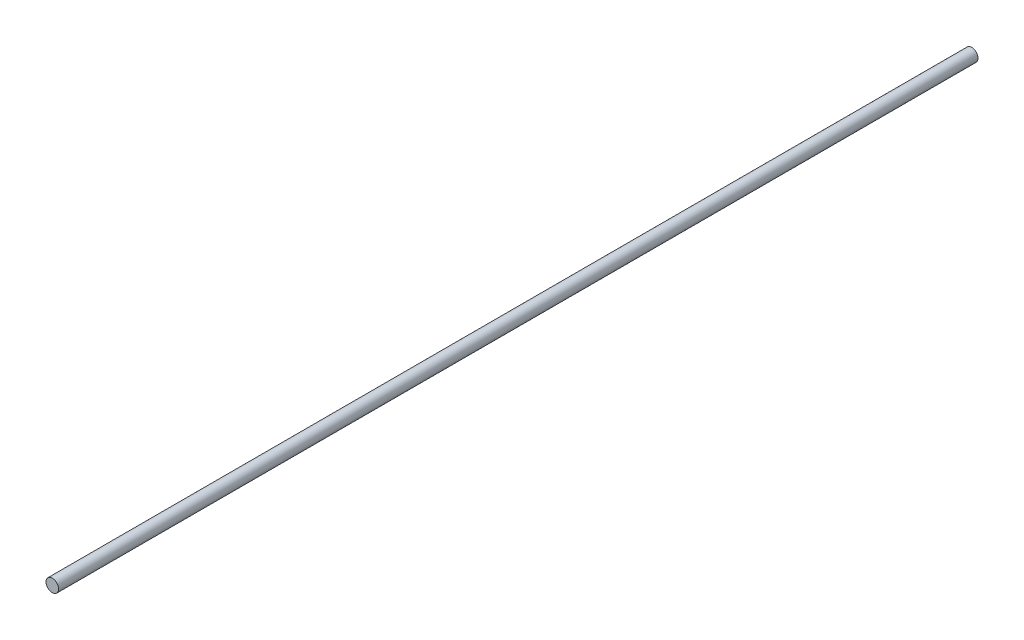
from build123d import *

# Parameters (mm, degrees)
SKETCH_2_R      = 10
EXTRUDE_1_DEPTH = 730


with BuildPart() as part:
    # Sketch 2 → Extrude 1 (new, symmetric)
    with BuildSketch(Plane.XY):
        with Locations(Location((0, 0, 0), (0, 0, 180))):
            Circle(SKETCH_2_R)
    extrude(amount=EXTRUDE_1_DEPTH, both=True)


solid = part.part
